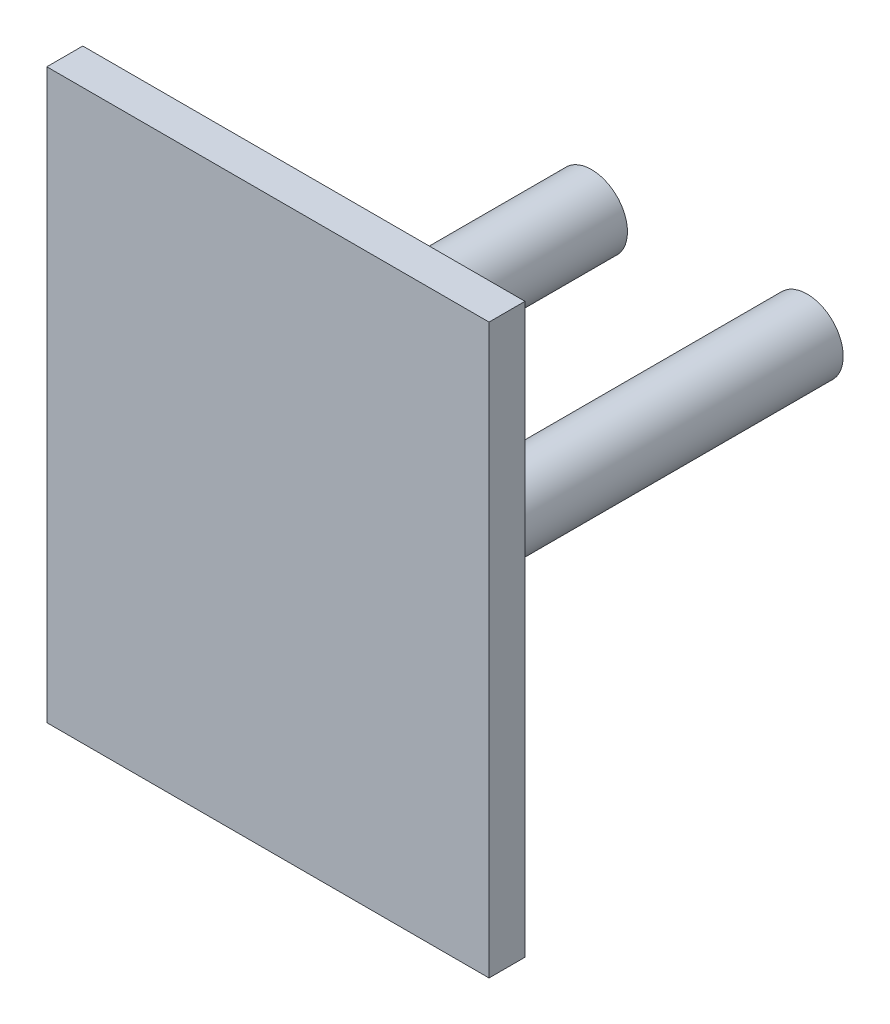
from build123d import *

# Parameters (mm, degrees)
EXTRUSION1_DEPTH = 10
ESQUISSE2_R      = 10
EXTRUSION2_DEPTH = 120


with BuildPart() as part:
    # Esquisse1 → Extrusion1 (new body)
    with BuildSketch(Plane.XY):
        Polygon((-61.5, -79), (-61.5, 79), (0, 79), (61.5, 79), (61.5, -79), (0, -79), align=None)
    extrude(amount=EXTRUSION1_DEPTH)

    # Esquisse2 → Extrusion2 (add)
    with BuildSketch(Plane.XY.offset(10)):
        with Locations((30, 0)):
            Circle(ESQUISSE2_R)
        with Locations((-30, 0)):
            Circle(ESQUISSE2_R)
    extrude(amount=-EXTRUSION2_DEPTH)


solid = part.part
